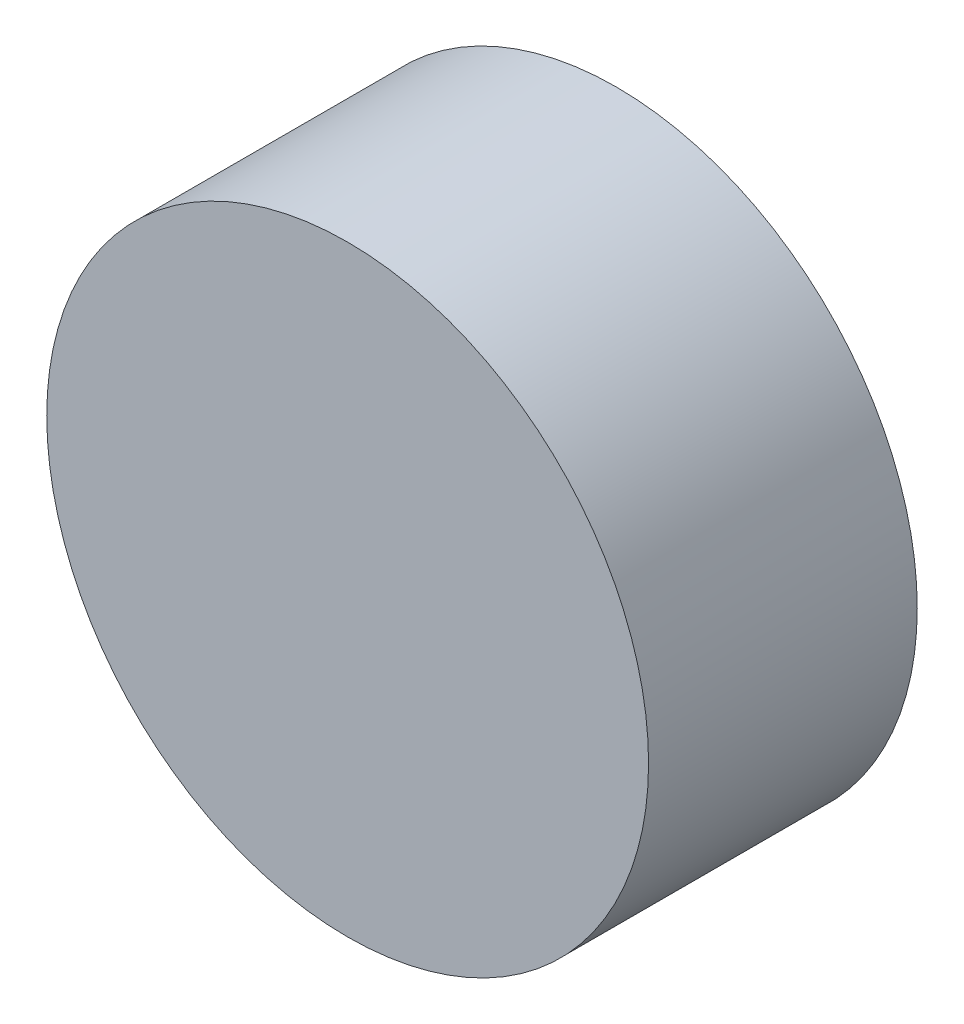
ISO-10303-21;
HEADER;
FILE_DESCRIPTION(('STEP AP214'),'2;1');
FILE_NAME('part.step','',(''),(''),'','','');
FILE_SCHEMA(('AUTOMOTIVE_DESIGN { 1 0 10303 214 1 1 1 1 }'));
ENDSEC;
DATA;
#1=APPLICATION_CONTEXT('core data for automotive mechanical design processes');
#2=APPLICATION_PROTOCOL_DEFINITION('international standard','automotive_design',2000,#1);
#3=PRODUCT_CONTEXT('',#1,'mechanical');
#4=PRODUCT('Part','Part','',(#3));
#5=PRODUCT_RELATED_PRODUCT_CATEGORY('part','',(#4));
#6=PRODUCT_DEFINITION_FORMATION('','',#4);
#7=PRODUCT_DEFINITION_CONTEXT('part definition',#1,'design');
#8=PRODUCT_DEFINITION('design','',#6,#7);
#9=PRODUCT_DEFINITION_SHAPE('','',#8);
#10=(LENGTH_UNIT() NAMED_UNIT(*) SI_UNIT(.MILLI.,.METRE.));
#11=(NAMED_UNIT(*) PLANE_ANGLE_UNIT() SI_UNIT($,.RADIAN.));
#12=(NAMED_UNIT(*) SI_UNIT($,.STERADIAN.) SOLID_ANGLE_UNIT());
#13=UNCERTAINTY_MEASURE_WITH_UNIT(LENGTH_MEASURE(1.E-05),#10,'distance_accuracy_value','');
#14=(GEOMETRIC_REPRESENTATION_CONTEXT(3) GLOBAL_UNCERTAINTY_ASSIGNED_CONTEXT((#13)) GLOBAL_UNIT_ASSIGNED_CONTEXT((#10,
#11,#12)) REPRESENTATION_CONTEXT('',''));
#15=CARTESIAN_POINT('',(0.,0.,0.));
#16=DIRECTION('',(0.,0.,1.));
#17=DIRECTION('',(1.,0.,0.));
#18=AXIS2_PLACEMENT_3D('',#15,#16,#17);
#19=CARTESIAN_POINT('',(0.,0.,12.5));
#20=DIRECTION('',(0.,0.,-1.));
#21=DIRECTION('',(-1.,0.,0.));
#22=AXIS2_PLACEMENT_3D('',#19,#20,#21);
#23=CYLINDRICAL_SURFACE('',#22,28.000000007);
#24=CARTESIAN_POINT('',(0.,0.,12.5));
#25=DIRECTION('',(0.,0.,1.));
#26=DIRECTION('',(1.,0.,0.));
#27=AXIS2_PLACEMENT_3D('',#24,#25,#26);
#28=CIRCLE('',#27,28.000000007);
#29=CARTESIAN_POINT('',(28.000000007,0.,12.5));
#30=VERTEX_POINT('',#29);
#31=EDGE_CURVE('E10',#30,#30,#28,.T.);
#32=ORIENTED_EDGE('',*,*,#31,.F.);
#33=EDGE_LOOP('',(#32));
#34=FACE_BOUND('',#33,.T.);
#35=CARTESIAN_POINT('',(0.,0.,-12.5));
#36=DIRECTION('',(0.,0.,1.));
#37=DIRECTION('',(1.,0.,0.));
#38=AXIS2_PLACEMENT_3D('',#35,#36,#37);
#39=CIRCLE('',#38,28.000000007);
#40=CARTESIAN_POINT('',(28.000000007,0.,-12.5));
#41=VERTEX_POINT('',#40);
#42=EDGE_CURVE('E34',#41,#41,#39,.T.);
#43=ORIENTED_EDGE('',*,*,#42,.T.);
#44=EDGE_LOOP('',(#43));
#45=FACE_BOUND('',#44,.T.);
#46=ADVANCED_FACE('F31',(#34,#45),#23,.T.);
#47=CARTESIAN_POINT('',(0.,0.,12.5));
#48=DIRECTION('',(0.,0.,1.));
#49=DIRECTION('',(1.,0.,0.));
#50=AXIS2_PLACEMENT_3D('',#47,#48,#49);
#51=PLANE('',#50);
#52=ORIENTED_EDGE('',*,*,#31,.T.);
#53=EDGE_LOOP('',(#52));
#54=FACE_BOUND('',#53,.T.);
#55=ADVANCED_FACE('F46',(#54),#51,.T.);
#56=CARTESIAN_POINT('',(0.,0.,-12.5));
#57=DIRECTION('',(0.,0.,1.));
#58=DIRECTION('',(1.,0.,0.));
#59=AXIS2_PLACEMENT_3D('',#56,#57,#58);
#60=PLANE('',#59);
#61=ORIENTED_EDGE('',*,*,#42,.F.);
#62=EDGE_LOOP('',(#61));
#63=FACE_BOUND('',#62,.T.);
#64=ADVANCED_FACE('F44',(#63),#60,.F.);
#65=CLOSED_SHELL('',(#46,#55,#64));
#66=MANIFOLD_SOLID_BREP('B2',#65);
#67=ADVANCED_BREP_SHAPE_REPRESENTATION('',(#18,#66),#14);
#68=SHAPE_DEFINITION_REPRESENTATION(#9,#67);
ENDSEC;
END-ISO-10303-21;
